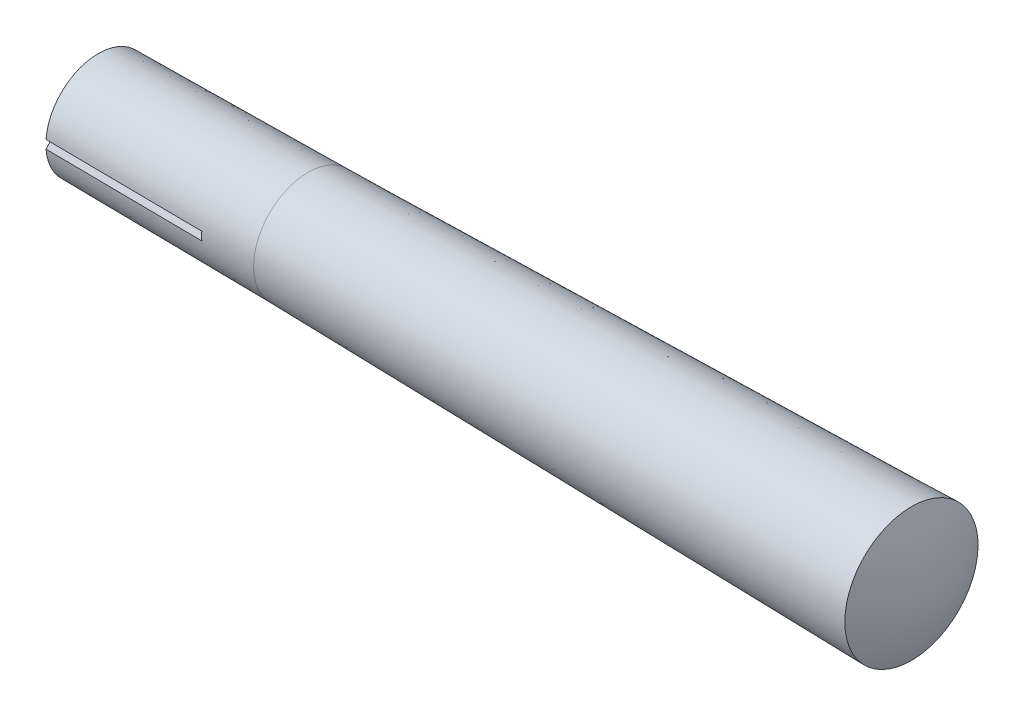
from build123d import *

# Parameters (mm, degrees)
SPLIT_2_DEPTH      = 30
SPLIT_2_DEPTH_BACK = 159.520787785
SPLSKE_W           = 25.4004
SPLSKE_H           = 1.6


with BuildPart() as part:
    # BodySke → BaseBody (revolve)
    with BuildSketch(Plane.XY, mode=Mode.PRIVATE) as basebody_sk:
        with BuildLine():
            Line((0, 10), (40, 10.4))
            Line((40, 10.4), (155.01, 12.7002))
            ThreePointArc((155.01, 12.7002), (156.87163014, 6.470996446), (157.5, 0))
            Line((157.5, 0), (-2.5, 0))
            ThreePointArc((-2.5, 0), (-1.905301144, 5.163825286), (0, 10))
        make_face()
    revolve(basebody_sk.sketch.rotate(Axis((0, 0, 0), (1, 0, 0)), 90), axis=Axis((0, 0, 0), (1, 0, 0)))

    # SplSke → Split 2 (cut, two sides: drawn at the far end of the back side and taken through both)
    with BuildSketch(Plane(origin=(0, 0, 0), x_dir=(0, 0, -1), z_dir=(1, 0, 0)).offset(-SPLIT_2_DEPTH_BACK)):
        Rectangle(SPLSKE_W, SPLSKE_H)
    extrude(amount=SPLIT_2_DEPTH + SPLIT_2_DEPTH_BACK, mode=Mode.SUBTRACT)


solid = part.part
